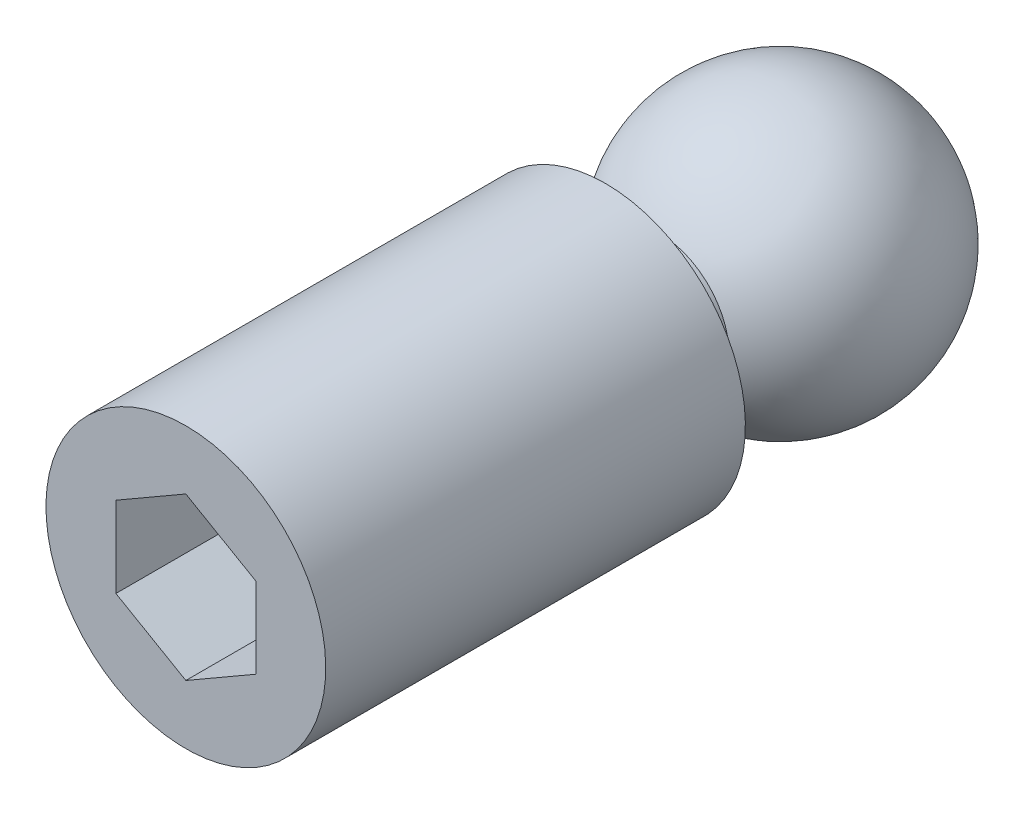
ISO-10303-21;
HEADER;
FILE_DESCRIPTION(('STEP AP214'),'2;1');
FILE_NAME('part.step','',(''),(''),'','','');
FILE_SCHEMA(('AUTOMOTIVE_DESIGN { 1 0 10303 214 1 1 1 1 }'));
ENDSEC;
DATA;
#1=APPLICATION_CONTEXT('core data for automotive mechanical design processes');
#2=APPLICATION_PROTOCOL_DEFINITION('international standard','automotive_design',2000,#1);
#3=PRODUCT_CONTEXT('',#1,'mechanical');
#4=PRODUCT('Part','Part','',(#3));
#5=PRODUCT_RELATED_PRODUCT_CATEGORY('part','',(#4));
#6=PRODUCT_DEFINITION_FORMATION('','',#4);
#7=PRODUCT_DEFINITION_CONTEXT('part definition',#1,'design');
#8=PRODUCT_DEFINITION('design','',#6,#7);
#9=PRODUCT_DEFINITION_SHAPE('','',#8);
#10=(LENGTH_UNIT() NAMED_UNIT(*) SI_UNIT(.MILLI.,.METRE.));
#11=(NAMED_UNIT(*) PLANE_ANGLE_UNIT() SI_UNIT($,.RADIAN.));
#12=(NAMED_UNIT(*) SI_UNIT($,.STERADIAN.) SOLID_ANGLE_UNIT());
#13=UNCERTAINTY_MEASURE_WITH_UNIT(LENGTH_MEASURE(1.E-05),#10,'distance_accuracy_value','');
#14=(GEOMETRIC_REPRESENTATION_CONTEXT(3) GLOBAL_UNCERTAINTY_ASSIGNED_CONTEXT((#13)) GLOBAL_UNIT_ASSIGNED_CONTEXT((#10,
#11,#12)) REPRESENTATION_CONTEXT('',''));
#15=CARTESIAN_POINT('',(0.,0.,0.));
#16=DIRECTION('',(0.,0.,1.));
#17=DIRECTION('',(1.,0.,0.));
#18=AXIS2_PLACEMENT_3D('',#15,#16,#17);
#19=CARTESIAN_POINT('',(0.,0.,4.));
#20=DIRECTION('',(0.,-1.,0.));
#21=DIRECTION('',(-1.,0.,0.));
#22=AXIS2_PLACEMENT_3D('',#19,#20,#21);
#23=SPHERICAL_SURFACE('',#22,4.);
#24=CARTESIAN_POINT('',(0.,0.,4.));
#25=DIRECTION('',(0.,0.,1.));
#26=DIRECTION('',(0.,1.,0.));
#27=AXIS2_PLACEMENT_3D('',#24,#25,#26);
#28=SPHERICAL_SURFACE('',#27,4.);
#29=CARTESIAN_POINT('',(0.,0.,7.46410161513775));
#30=DIRECTION('',(0.,0.,1.));
#31=DIRECTION('',(0.,1.,0.));
#32=AXIS2_PLACEMENT_3D('',#29,#30,#31);
#33=CIRCLE('',#32,2.);
#34=CARTESIAN_POINT('',(0.,2.,7.46410161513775));
#35=VERTEX_POINT('',#34);
#36=EDGE_CURVE('E9',#35,#35,#33,.T.);
#37=ORIENTED_EDGE('',*,*,#36,.F.);
#38=EDGE_LOOP('',(#37));
#39=FACE_BOUND('',#38,.T.);
#40=ADVANCED_FACE('F14',(#39),#28,.T.);
#41=CARTESIAN_POINT('',(0.,0.,30.));
#42=DIRECTION('',(0.,0.,1.));
#43=DIRECTION('',(0.,1.,0.));
#44=AXIS2_PLACEMENT_3D('',#41,#42,#43);
#45=CYLINDRICAL_SURFACE('',#44,2.);
#46=ORIENTED_EDGE('',*,*,#36,.T.);
#47=EDGE_LOOP('',(#46));
#48=FACE_BOUND('',#47,.T.);
#49=CARTESIAN_POINT('',(0.,0.,9.));
#50=DIRECTION('',(0.,0.,1.));
#51=DIRECTION('',(0.,1.,0.));
#52=AXIS2_PLACEMENT_3D('',#49,#50,#51);
#53=CIRCLE('',#52,2.);
#54=CARTESIAN_POINT('',(0.,2.,9.));
#55=VERTEX_POINT('',#54);
#56=EDGE_CURVE('E21',#55,#55,#53,.T.);
#57=ORIENTED_EDGE('',*,*,#56,.F.);
#58=EDGE_LOOP('',(#57));
#59=FACE_BOUND('',#58,.T.);
#60=ADVANCED_FACE('F131',(#48,#59),#45,.T.);
#61=CARTESIAN_POINT('',(0.,-4.,9.));
#62=DIRECTION('',(0.,0.,-1.));
#63=DIRECTION('',(0.,-1.,0.));
#64=AXIS2_PLACEMENT_3D('',#61,#62,#63);
#65=PLANE('',#64);
#66=ORIENTED_EDGE('',*,*,#56,.T.);
#67=EDGE_LOOP('',(#66));
#68=FACE_BOUND('',#67,.T.);
#69=CARTESIAN_POINT('',(0.,0.,9.));
#70=DIRECTION('',(0.,0.,1.));
#71=DIRECTION('',(0.,1.,0.));
#72=AXIS2_PLACEMENT_3D('',#69,#70,#71);
#73=CIRCLE('',#72,4.);
#74=CARTESIAN_POINT('',(0.,4.,9.));
#75=VERTEX_POINT('',#74);
#76=EDGE_CURVE('E123',#75,#75,#73,.T.);
#77=ORIENTED_EDGE('',*,*,#76,.F.);
#78=EDGE_LOOP('',(#77));
#79=FACE_BOUND('',#78,.T.);
#80=ADVANCED_FACE('F128',(#68,#79),#65,.T.);
#81=CARTESIAN_POINT('',(0.,0.,30.));
#82=DIRECTION('',(0.,0.,1.));
#83=DIRECTION('',(0.,1.,0.));
#84=AXIS2_PLACEMENT_3D('',#81,#82,#83);
#85=CYLINDRICAL_SURFACE('',#84,4.);
#86=ORIENTED_EDGE('',*,*,#76,.T.);
#87=EDGE_LOOP('',(#86));
#88=FACE_BOUND('',#87,.T.);
#89=CARTESIAN_POINT('',(0.,0.,21.));
#90=DIRECTION('',(0.,0.,1.));
#91=DIRECTION('',(0.,1.,0.));
#92=AXIS2_PLACEMENT_3D('',#89,#90,#91);
#93=CIRCLE('',#92,4.);
#94=CARTESIAN_POINT('',(0.,4.,21.));
#95=VERTEX_POINT('',#94);
#96=EDGE_CURVE('E115',#95,#95,#93,.T.);
#97=ORIENTED_EDGE('',*,*,#96,.F.);
#98=EDGE_LOOP('',(#97));
#99=FACE_BOUND('',#98,.T.);
#100=ADVANCED_FACE('F139',(#88,#99),#85,.T.);
#101=CARTESIAN_POINT('',(0.,0.,21.));
#102=DIRECTION('',(0.,0.,1.));
#103=DIRECTION('',(0.,1.,0.));
#104=AXIS2_PLACEMENT_3D('',#101,#102,#103);
#105=PLANE('',#104);
#106=DIRECTION('',(-0.866025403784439,0.5,0.));
#107=VECTOR('',#106,1.);
#108=CARTESIAN_POINT('',(2.,1.15470053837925,21.));
#109=LINE('',#108,#107);
#110=CARTESIAN_POINT('',(2.,1.15470053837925,21.));
#111=VERTEX_POINT('',#110);
#112=CARTESIAN_POINT('',(0.,2.30940107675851,21.));
#113=VERTEX_POINT('',#112);
#114=EDGE_CURVE('E28',#111,#113,#109,.T.);
#115=ORIENTED_EDGE('',*,*,#114,.F.);
#116=DIRECTION('',(0.,1.,0.));
#117=VECTOR('',#116,1.);
#118=CARTESIAN_POINT('',(2.,-1.15470053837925,21.));
#119=LINE('',#118,#117);
#120=CARTESIAN_POINT('',(2.,-1.15470053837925,21.));
#121=VERTEX_POINT('',#120);
#122=EDGE_CURVE('E111',#121,#111,#119,.T.);
#123=ORIENTED_EDGE('',*,*,#122,.F.);
#124=DIRECTION('',(0.866025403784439,0.5,0.));
#125=VECTOR('',#124,1.);
#126=CARTESIAN_POINT('',(0.,-2.30940107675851,21.));
#127=LINE('',#126,#125);
#128=CARTESIAN_POINT('',(0.,-2.30940107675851,21.));
#129=VERTEX_POINT('',#128);
#130=EDGE_CURVE('E109',#129,#121,#127,.T.);
#131=ORIENTED_EDGE('',*,*,#130,.F.);
#132=DIRECTION('',(0.866025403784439,-0.5,0.));
#133=VECTOR('',#132,1.);
#134=CARTESIAN_POINT('',(-2.,-1.15470053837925,21.));
#135=LINE('',#134,#133);
#136=CARTESIAN_POINT('',(-2.,-1.15470053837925,21.));
#137=VERTEX_POINT('',#136);
#138=EDGE_CURVE('E76',#137,#129,#135,.T.);
#139=ORIENTED_EDGE('',*,*,#138,.F.);
#140=DIRECTION('',(0.,-1.,0.));
#141=VECTOR('',#140,1.);
#142=CARTESIAN_POINT('',(-2.,1.15470053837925,21.));
#143=LINE('',#142,#141);
#144=CARTESIAN_POINT('',(-2.,1.15470053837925,21.));
#145=VERTEX_POINT('',#144);
#146=EDGE_CURVE('E105',#145,#137,#143,.T.);
#147=ORIENTED_EDGE('',*,*,#146,.F.);
#148=DIRECTION('',(-0.866025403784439,-0.5,0.));
#149=VECTOR('',#148,1.);
#150=CARTESIAN_POINT('',(0.,2.30940107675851,21.));
#151=LINE('',#150,#149);
#152=EDGE_CURVE('E102',#113,#145,#151,.T.);
#153=ORIENTED_EDGE('',*,*,#152,.F.);
#154=EDGE_LOOP('',(#115,#123,#131,#139,#147,#153));
#155=FACE_BOUND('',#154,.T.);
#156=ORIENTED_EDGE('',*,*,#96,.T.);
#157=EDGE_LOOP('',(#156));
#158=FACE_BOUND('',#157,.T.);
#159=ADVANCED_FACE('F145',(#155,#158),#105,.T.);
#160=CARTESIAN_POINT('',(2.,1.15470053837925,16.));
#161=DIRECTION('',(0.5,0.866025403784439,0.));
#162=DIRECTION('',(-0.866025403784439,0.5,0.));
#163=AXIS2_PLACEMENT_3D('',#160,#161,#162);
#164=PLANE('',#163);
#165=ORIENTED_EDGE('',*,*,#114,.T.);
#166=DIRECTION('',(0.,0.,1.));
#167=VECTOR('',#166,1.);
#168=CARTESIAN_POINT('',(0.,2.30940107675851,16.));
#169=LINE('',#168,#167);
#170=CARTESIAN_POINT('',(0.,2.30940107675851,16.));
#171=VERTEX_POINT('',#170);
#172=EDGE_CURVE('E58',#171,#113,#169,.T.);
#173=ORIENTED_EDGE('',*,*,#172,.F.);
#174=DIRECTION('',(-0.866025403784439,0.5,0.));
#175=VECTOR('',#174,1.);
#176=CARTESIAN_POINT('',(2.,1.15470053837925,16.));
#177=LINE('',#176,#175);
#178=CARTESIAN_POINT('',(2.,1.15470053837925,16.));
#179=VERTEX_POINT('',#178);
#180=EDGE_CURVE('E113',#179,#171,#177,.T.);
#181=ORIENTED_EDGE('',*,*,#180,.F.);
#182=DIRECTION('',(0.,0.,1.));
#183=VECTOR('',#182,1.);
#184=CARTESIAN_POINT('',(2.,1.15470053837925,16.));
#185=LINE('',#184,#183);
#186=EDGE_CURVE('E36',#179,#111,#185,.T.);
#187=ORIENTED_EDGE('',*,*,#186,.T.);
#188=EDGE_LOOP('',(#165,#173,#181,#187));
#189=FACE_BOUND('',#188,.T.);
#190=ADVANCED_FACE('F149',(#189),#164,.F.);
#191=CARTESIAN_POINT('',(2.,-1.15470053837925,16.));
#192=DIRECTION('',(1.,0.,0.));
#193=DIRECTION('',(0.,0.,-1.));
#194=AXIS2_PLACEMENT_3D('',#191,#192,#193);
#195=PLANE('',#194);
#196=ORIENTED_EDGE('',*,*,#122,.T.);
#197=ORIENTED_EDGE('',*,*,#186,.F.);
#198=DIRECTION('',(0.,1.,0.));
#199=VECTOR('',#198,1.);
#200=CARTESIAN_POINT('',(2.,-1.15470053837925,16.));
#201=LINE('',#200,#199);
#202=CARTESIAN_POINT('',(2.,-1.15470053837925,16.));
#203=VERTEX_POINT('',#202);
#204=EDGE_CURVE('E88',#203,#179,#201,.T.);
#205=ORIENTED_EDGE('',*,*,#204,.F.);
#206=DIRECTION('',(0.,0.,1.));
#207=VECTOR('',#206,1.);
#208=CARTESIAN_POINT('',(2.,-1.15470053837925,16.));
#209=LINE('',#208,#207);
#210=EDGE_CURVE('E80',#203,#121,#209,.T.);
#211=ORIENTED_EDGE('',*,*,#210,.T.);
#212=EDGE_LOOP('',(#196,#197,#205,#211));
#213=FACE_BOUND('',#212,.T.);
#214=ADVANCED_FACE('F153',(#213),#195,.F.);
#215=CARTESIAN_POINT('',(0.,-2.30940107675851,16.));
#216=DIRECTION('',(0.5,-0.866025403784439,0.));
#217=DIRECTION('',(0.866025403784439,0.5,0.));
#218=AXIS2_PLACEMENT_3D('',#215,#216,#217);
#219=PLANE('',#218);
#220=ORIENTED_EDGE('',*,*,#130,.T.);
#221=ORIENTED_EDGE('',*,*,#210,.F.);
#222=DIRECTION('',(0.866025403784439,0.5,0.));
#223=VECTOR('',#222,1.);
#224=CARTESIAN_POINT('',(0.,-2.30940107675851,16.));
#225=LINE('',#224,#223);
#226=CARTESIAN_POINT('',(0.,-2.30940107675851,16.));
#227=VERTEX_POINT('',#226);
#228=EDGE_CURVE('E84',#227,#203,#225,.T.);
#229=ORIENTED_EDGE('',*,*,#228,.F.);
#230=DIRECTION('',(0.,0.,1.));
#231=VECTOR('',#230,1.);
#232=CARTESIAN_POINT('',(0.,-2.30940107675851,16.));
#233=LINE('',#232,#231);
#234=EDGE_CURVE('E69',#227,#129,#233,.T.);
#235=ORIENTED_EDGE('',*,*,#234,.T.);
#236=EDGE_LOOP('',(#220,#221,#229,#235));
#237=FACE_BOUND('',#236,.T.);
#238=ADVANCED_FACE('F85',(#237),#219,.F.);
#239=CARTESIAN_POINT('',(-2.,-1.15470053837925,16.));
#240=DIRECTION('',(-0.5,-0.866025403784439,0.));
#241=DIRECTION('',(0.866025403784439,-0.5,0.));
#242=AXIS2_PLACEMENT_3D('',#239,#240,#241);
#243=PLANE('',#242);
#244=ORIENTED_EDGE('',*,*,#138,.T.);
#245=ORIENTED_EDGE('',*,*,#234,.F.);
#246=DIRECTION('',(0.866025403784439,-0.5,0.));
#247=VECTOR('',#246,1.);
#248=CARTESIAN_POINT('',(-2.,-1.15470053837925,16.));
#249=LINE('',#248,#247);
#250=CARTESIAN_POINT('',(-2.,-1.15470053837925,16.));
#251=VERTEX_POINT('',#250);
#252=EDGE_CURVE('E73',#251,#227,#249,.T.);
#253=ORIENTED_EDGE('',*,*,#252,.F.);
#254=DIRECTION('',(0.,0.,1.));
#255=VECTOR('',#254,1.);
#256=CARTESIAN_POINT('',(-2.,-1.15470053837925,16.));
#257=LINE('',#256,#255);
#258=EDGE_CURVE('E81',#251,#137,#257,.T.);
#259=ORIENTED_EDGE('',*,*,#258,.T.);
#260=EDGE_LOOP('',(#244,#245,#253,#259));
#261=FACE_BOUND('',#260,.T.);
#262=ADVANCED_FACE('F71',(#261),#243,.F.);
#263=CARTESIAN_POINT('',(-2.,1.15470053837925,16.));
#264=DIRECTION('',(-1.,0.,0.));
#265=DIRECTION('',(0.,-1.,0.));
#266=AXIS2_PLACEMENT_3D('',#263,#264,#265);
#267=PLANE('',#266);
#268=ORIENTED_EDGE('',*,*,#146,.T.);
#269=ORIENTED_EDGE('',*,*,#258,.F.);
#270=DIRECTION('',(0.,-1.,0.));
#271=VECTOR('',#270,1.);
#272=CARTESIAN_POINT('',(-2.,1.15470053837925,16.));
#273=LINE('',#272,#271);
#274=CARTESIAN_POINT('',(-2.,1.15470053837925,16.));
#275=VERTEX_POINT('',#274);
#276=EDGE_CURVE('E94',#275,#251,#273,.T.);
#277=ORIENTED_EDGE('',*,*,#276,.F.);
#278=DIRECTION('',(0.,0.,1.));
#279=VECTOR('',#278,1.);
#280=CARTESIAN_POINT('',(-2.,1.15470053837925,16.));
#281=LINE('',#280,#279);
#282=EDGE_CURVE('E118',#275,#145,#281,.T.);
#283=ORIENTED_EDGE('',*,*,#282,.T.);
#284=EDGE_LOOP('',(#268,#269,#277,#283));
#285=FACE_BOUND('',#284,.T.);
#286=ADVANCED_FACE('F157',(#285),#267,.F.);
#287=CARTESIAN_POINT('',(0.,2.30940107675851,16.));
#288=DIRECTION('',(-0.5,0.866025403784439,0.));
#289=DIRECTION('',(-0.866025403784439,-0.5,0.));
#290=AXIS2_PLACEMENT_3D('',#287,#288,#289);
#291=PLANE('',#290);
#292=ORIENTED_EDGE('',*,*,#152,.T.);
#293=ORIENTED_EDGE('',*,*,#282,.F.);
#294=DIRECTION('',(-0.866025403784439,-0.5,0.));
#295=VECTOR('',#294,1.);
#296=CARTESIAN_POINT('',(0.,2.30940107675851,16.));
#297=LINE('',#296,#295);
#298=EDGE_CURVE('E96',#171,#275,#297,.T.);
#299=ORIENTED_EDGE('',*,*,#298,.F.);
#300=ORIENTED_EDGE('',*,*,#172,.T.);
#301=EDGE_LOOP('',(#292,#293,#299,#300));
#302=FACE_BOUND('',#301,.T.);
#303=ADVANCED_FACE('F154',(#302),#291,.F.);
#304=CARTESIAN_POINT('',(0.,2.30940107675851,16.));
#305=DIRECTION('',(0.,0.,1.));
#306=DIRECTION('',(1.,0.,0.));
#307=AXIS2_PLACEMENT_3D('',#304,#305,#306);
#308=PLANE('',#307);
#309=ORIENTED_EDGE('',*,*,#180,.T.);
#310=ORIENTED_EDGE('',*,*,#298,.T.);
#311=ORIENTED_EDGE('',*,*,#276,.T.);
#312=ORIENTED_EDGE('',*,*,#252,.T.);
#313=ORIENTED_EDGE('',*,*,#228,.T.);
#314=ORIENTED_EDGE('',*,*,#204,.T.);
#315=EDGE_LOOP('',(#309,#310,#311,#312,#313,#314));
#316=FACE_BOUND('',#315,.T.);
#317=ADVANCED_FACE('F91',(#316),#308,.T.);
#318=CLOSED_SHELL('',(#40,#60,#80,#100,#159,#190,#214,#238,#262,#286,#303,#317));
#319=MANIFOLD_SOLID_BREP('B1',#318);
#320=ADVANCED_BREP_SHAPE_REPRESENTATION('',(#18,#319),#14);
#321=SHAPE_DEFINITION_REPRESENTATION(#9,#320);
ENDSEC;
END-ISO-10303-21;
